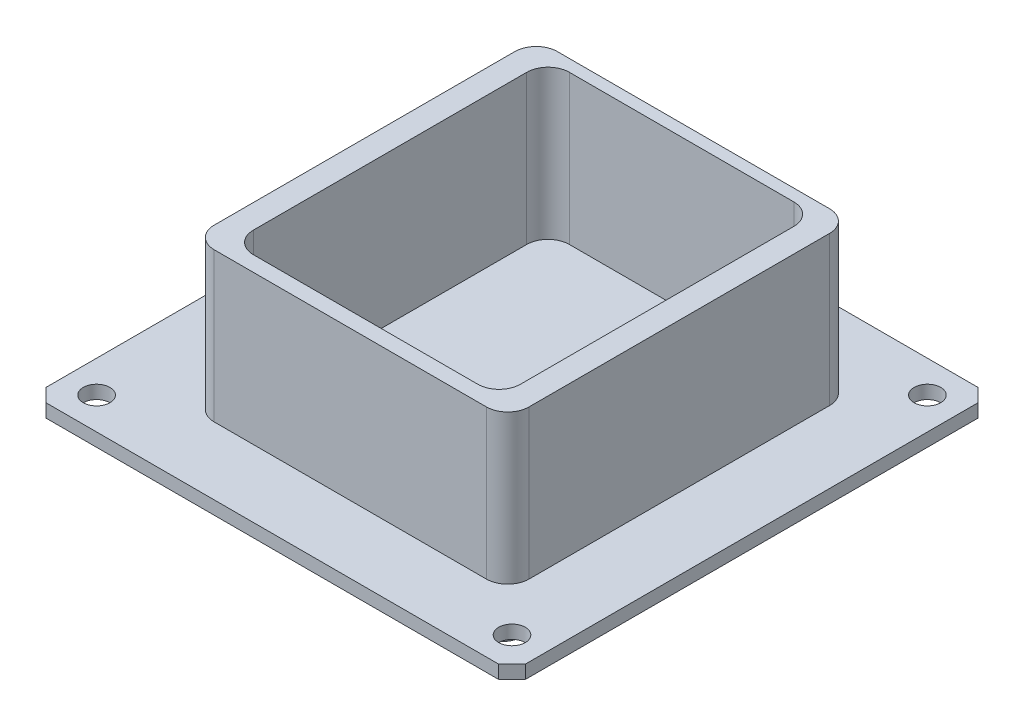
from build123d import *

# Parameters (mm, degrees)
SKETCH1_R      = 1.5875
EXTRUDE1_DEPTH = 1.5875
SKETCH2_W      = 37.538920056
SKETCH2_H      = 40.923211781
SKETCH2_W_2    = 31.839060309
SKETCH2_H_2    = 37.672510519
EXTRUDE2_DEPTH = 17.78
SKETCH3_W      = 34.644460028
SKETCH3_H      = 42.036465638
EXTRUDE3_DEPTH = 5.08
FILLET1_R      = 2.54


with BuildPart() as part:
    # Sketch1 → Extrude1 (new body)
    with BuildSketch(Plane(origin=(0, 0, 0), x_dir=(1, 0, 0), z_dir=(0, 1, 0))):
        Polygon((1.5875, 0), (55.5625, 0), (57.15, 1.5875), (57.15, 55.5625), (55.5625, 57.15), (1.5875, 57.15), (0, 55.5625), (0, 1.5875), align=None)
        with Locations(Location((53.34, 3.81, 0), (0, 0, 270))):
            Circle(SKETCH1_R, mode=Mode.SUBTRACT)
        with Locations(Location((53.34, 53.34, 0), (0, 0, 90))):
            Circle(SKETCH1_R, mode=Mode.SUBTRACT)
        with Locations(Location((3.81, 53.34, 0), (0, 0, 270))):
            Circle(SKETCH1_R, mode=Mode.SUBTRACT)
        with Locations(Location((3.81, 3.81, 0), (0, 0, 90))):
            Circle(SKETCH1_R, mode=Mode.SUBTRACT)
    extrude(amount=EXTRUDE1_DEPTH)

    # Sketch2 → Extrude2 (add)
    with BuildSketch(Plane(origin=(0, 1.5875, 0), x_dir=(1, 0, 0), z_dir=(0, 1, 0))):
        with Locations((29.82184432, 28.508204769)):
            Rectangle(SKETCH2_W, SKETCH2_H)
        with Locations((29.82184432, 28.708590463)):
            Rectangle(SKETCH2_W_2, SKETCH2_H_2, mode=Mode.SUBTRACT)
    extrude(amount=EXTRUDE2_DEPTH)

    # Sketch3 → Extrude3 (add)
    with BuildSketch(Plane.XZ):
        with Locations((30.155820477, -29.421072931)):
            Rectangle(SKETCH3_W, SKETCH3_H)
    extrude(amount=EXTRUDE3_DEPTH)

    # Fillet1
    fillet1_edges = [part.edges().sort_by_distance(p)[0] for p in [
        (11.052384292, 10.4775, -48.969810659),
        (11.052384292, 10.4775, -8.046598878),
        (48.591304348, 10.4775, -8.046598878),
        (48.591304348, 10.4775, -48.969810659),
        (13.902314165, 10.4775, -9.872335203),
        (45.741374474, 10.4775, -9.872335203),
        (45.741374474, 10.4775, -47.544845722),
        (13.902314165, 10.4775, -47.544845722),
        (12.833590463, -2.54, -8.402840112),
        (12.833590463, -2.54, -50.43930575),
        (47.478050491, -2.54, -50.43930575),
        (47.478050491, -2.54, -8.402840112),
    ]]
    fillet(fillet1_edges, radius=FILLET1_R)


solid = part.part
